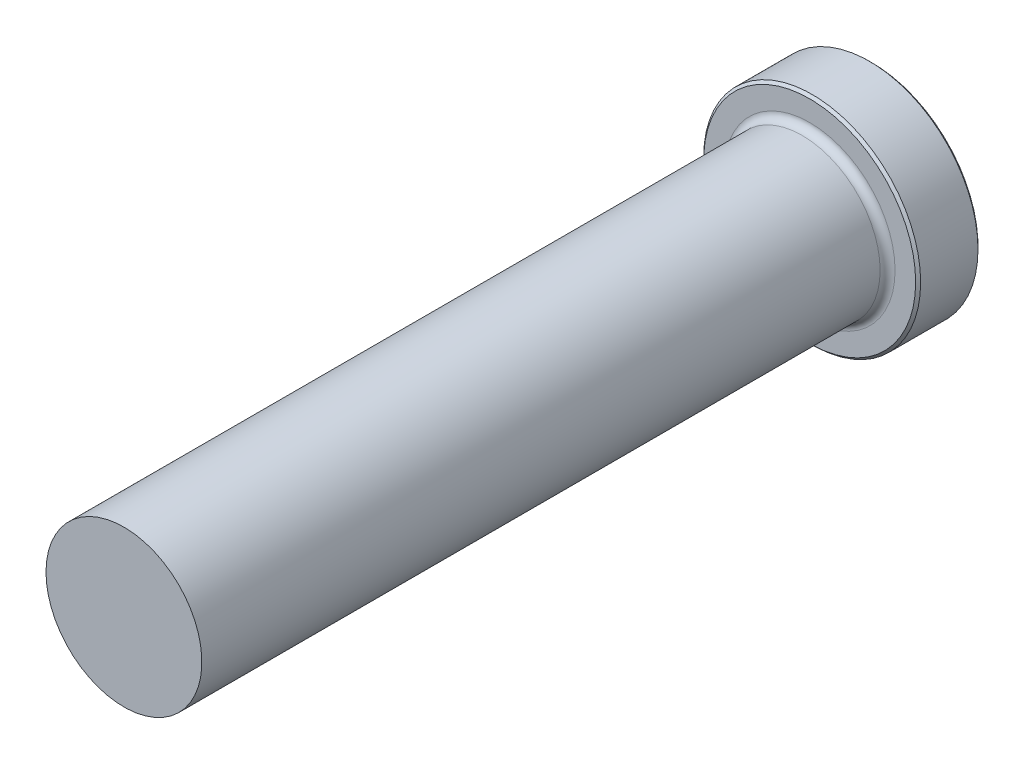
from build123d import *

# Parameters (mm, degrees)
FILLET1_R     = 0.762
CHAMFER1_SIZE = 0.254


with BuildPart() as part:
    # Sketch1 → Revolve1 (revolve)
    with BuildSketch(Plane(origin=(0, 0, 0), x_dir=(0, 0, -1), z_dir=(1, 0, 0)), mode=Mode.PRIVATE) as revolve1_sk:
        Polygon((0, 0), (0, 11.049), (-6.35, 11.049), (-6.35, 7.9375), (-76.2, 7.9375), (-76.2, 0), align=None)
    revolve(revolve1_sk.sketch.rotate(Axis((0, 0, 0), (0, 0, 1)), 90), axis=Axis((0, 0, 0), (0, 0, 1)))

    # Fillet1
    fillet1_edges = [part.edges().sort_by_distance(p)[0] for p in [
        (7.9375, 0, 6.35),
    ]]
    fillet(fillet1_edges, radius=FILLET1_R)

    # Chamfer1
    chamfer1_edges = [part.edges().sort_by_distance(p)[0] for p in [
        (11.049, 0, 6.35),
        (11.049, 0, 0),
    ]]
    chamfer(chamfer1_edges, length=CHAMFER1_SIZE)


solid = part.part
